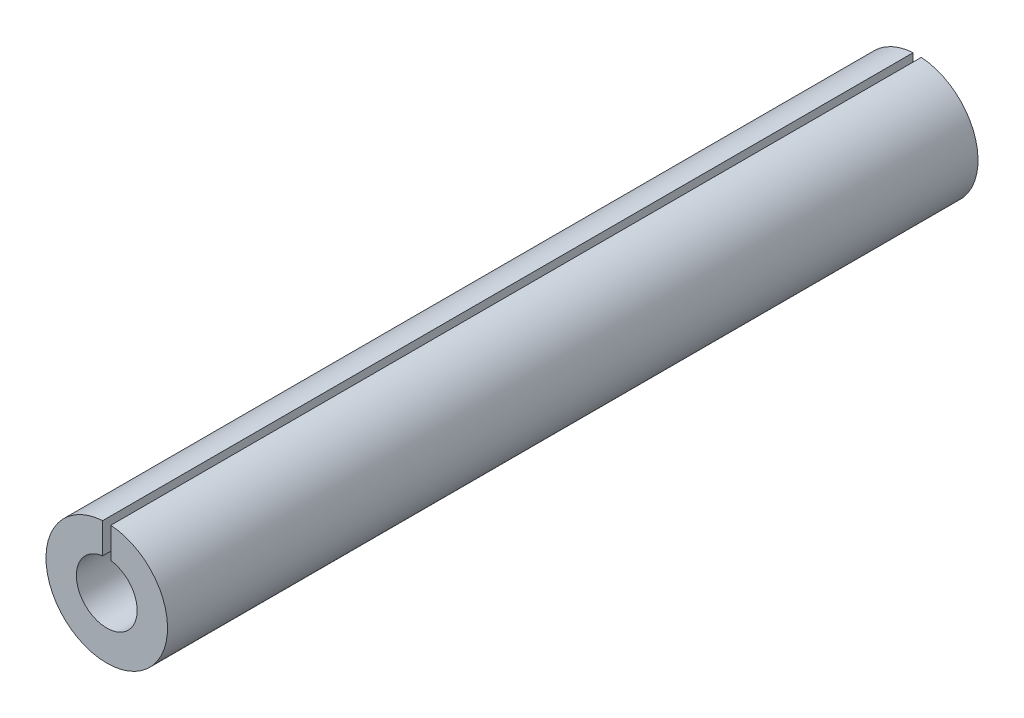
from build123d import *

# Parameters (mm, degrees)
ESQUISSE1_R             = 1.5
ESQUISSE1_R_2           = 0.75
BASE_EXTRUSION_DEPTH    = 20
ESQUISSE2_W             = 0.2
ESQUISSE2_H             = 1.580244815
ENL_V_MAT_EXTRU_1_DEPTH = 21.112185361


with BuildPart() as part:
    # Esquisse1 → Base-Extrusion (new body)
    with BuildSketch(Plane.XY):
        Circle(ESQUISSE1_R)
        Circle(ESQUISSE1_R_2, mode=Mode.SUBTRACT)
    extrude(amount=BASE_EXTRUSION_DEPTH)

    # Esquisse2 → Enl_v. mat.-Extru.1 (cut, through all)
    with BuildSketch(Plane.XY.offset(20)):
        with Locations((0, 0.790122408)):
            Rectangle(ESQUISSE2_W, ESQUISSE2_H)
    extrude(amount=-ENL_V_MAT_EXTRU_1_DEPTH, mode=Mode.SUBTRACT)


solid = part.part
